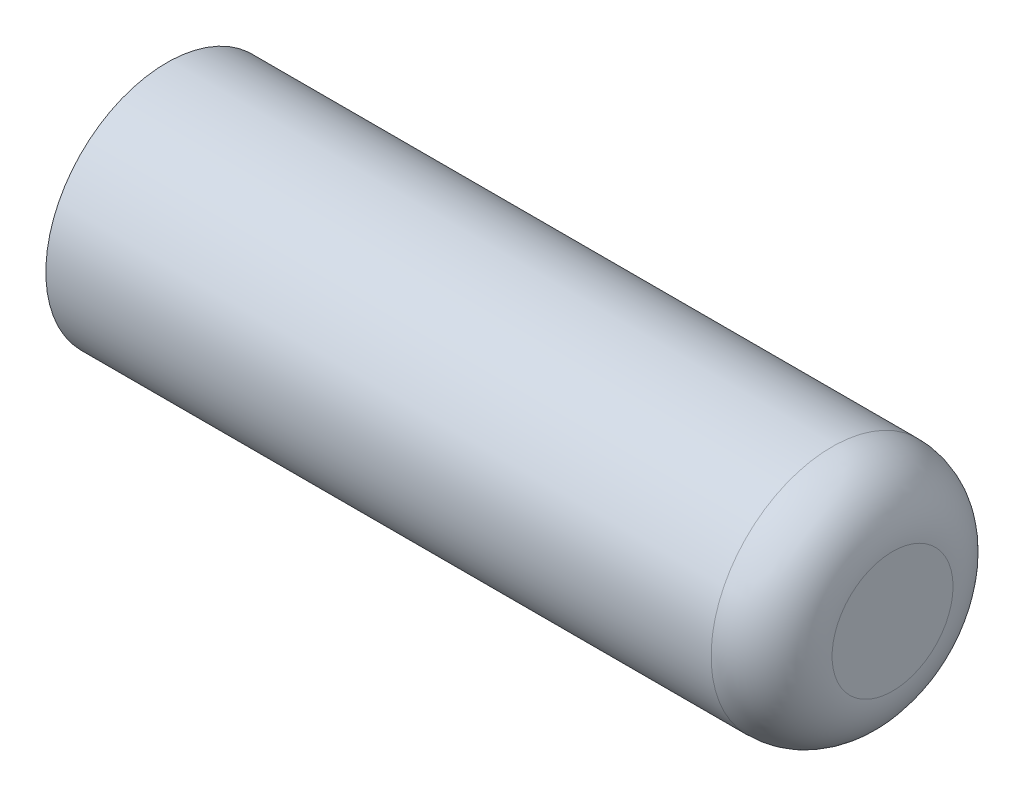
ISO-10303-21;
HEADER;
FILE_DESCRIPTION(('STEP AP214'),'2;1');
FILE_NAME('part.step','',(''),(''),'','','');
FILE_SCHEMA(('AUTOMOTIVE_DESIGN { 1 0 10303 214 1 1 1 1 }'));
ENDSEC;
DATA;
#1=APPLICATION_CONTEXT('core data for automotive mechanical design processes');
#2=APPLICATION_PROTOCOL_DEFINITION('international standard','automotive_design',2000,#1);
#3=PRODUCT_CONTEXT('',#1,'mechanical');
#4=PRODUCT('Part','Part','',(#3));
#5=PRODUCT_RELATED_PRODUCT_CATEGORY('part','',(#4));
#6=PRODUCT_DEFINITION_FORMATION('','',#4);
#7=PRODUCT_DEFINITION_CONTEXT('part definition',#1,'design');
#8=PRODUCT_DEFINITION('design','',#6,#7);
#9=PRODUCT_DEFINITION_SHAPE('','',#8);
#10=(LENGTH_UNIT() NAMED_UNIT(*) SI_UNIT(.MILLI.,.METRE.));
#11=(NAMED_UNIT(*) PLANE_ANGLE_UNIT() SI_UNIT($,.RADIAN.));
#12=(NAMED_UNIT(*) SI_UNIT($,.STERADIAN.) SOLID_ANGLE_UNIT());
#13=UNCERTAINTY_MEASURE_WITH_UNIT(LENGTH_MEASURE(1.E-05),#10,'distance_accuracy_value','');
#14=(GEOMETRIC_REPRESENTATION_CONTEXT(3) GLOBAL_UNCERTAINTY_ASSIGNED_CONTEXT((#13)) GLOBAL_UNIT_ASSIGNED_CONTEXT((#10,
#11,#12)) REPRESENTATION_CONTEXT('',''));
#15=CARTESIAN_POINT('',(0.,0.,0.));
#16=DIRECTION('',(0.,0.,1.));
#17=DIRECTION('',(1.,0.,0.));
#18=AXIS2_PLACEMENT_3D('',#15,#16,#17);
#19=CARTESIAN_POINT('',(30.,0.,0.));
#20=DIRECTION('',(-1.,0.,0.));
#21=DIRECTION('',(0.,0.,1.));
#22=AXIS2_PLACEMENT_3D('',#19,#20,#21);
#23=CYLINDRICAL_SURFACE('',#22,5.);
#24=CARTESIAN_POINT('',(27.5,0.,0.));
#25=DIRECTION('',(1.,0.,0.));
#26=DIRECTION('',(0.,0.,-1.));
#27=AXIS2_PLACEMENT_3D('',#24,#25,#26);
#28=CIRCLE('',#27,5.);
#29=CARTESIAN_POINT('',(27.5,0.,-5.));
#30=VERTEX_POINT('',#29);
#31=EDGE_CURVE('E10',#30,#30,#28,.F.);
#32=ORIENTED_EDGE('',*,*,#31,.T.);
#33=EDGE_LOOP('',(#32));
#34=FACE_BOUND('',#33,.T.);
#35=CARTESIAN_POINT('',(0.,0.,0.));
#36=DIRECTION('',(1.,0.,0.));
#37=DIRECTION('',(0.,0.,-1.));
#38=AXIS2_PLACEMENT_3D('',#35,#36,#37);
#39=CIRCLE('',#38,5.);
#40=CARTESIAN_POINT('',(0.,0.,-5.));
#41=VERTEX_POINT('',#40);
#42=EDGE_CURVE('E41',#41,#41,#39,.T.);
#43=ORIENTED_EDGE('',*,*,#42,.T.);
#44=EDGE_LOOP('',(#43));
#45=FACE_BOUND('',#44,.T.);
#46=ADVANCED_FACE('F30',(#34,#45),#23,.T.);
#47=CARTESIAN_POINT('',(30.,0.,0.));
#48=DIRECTION('',(1.,0.,0.));
#49=DIRECTION('',(0.,0.,-1.));
#50=AXIS2_PLACEMENT_3D('',#47,#48,#49);
#51=PLANE('',#50);
#52=CARTESIAN_POINT('',(30.,0.,0.));
#53=DIRECTION('',(1.,0.,0.));
#54=DIRECTION('',(0.,0.,-1.));
#55=AXIS2_PLACEMENT_3D('',#52,#53,#54);
#56=CIRCLE('',#55,2.5);
#57=CARTESIAN_POINT('',(30.,0.,-2.5));
#58=VERTEX_POINT('',#57);
#59=EDGE_CURVE('E37',#58,#58,#56,.T.);
#60=ORIENTED_EDGE('',*,*,#59,.T.);
#61=EDGE_LOOP('',(#60));
#62=FACE_BOUND('',#61,.T.);
#63=ADVANCED_FACE('F65',(#62),#51,.T.);
#64=CARTESIAN_POINT('',(0.,0.,0.));
#65=DIRECTION('',(1.,0.,0.));
#66=DIRECTION('',(0.,0.,-1.));
#67=AXIS2_PLACEMENT_3D('',#64,#65,#66);
#68=PLANE('',#67);
#69=CARTESIAN_POINT('',(0.,0.,0.));
#70=DIRECTION('',(-1.,0.,0.));
#71=DIRECTION('',(0.,0.,1.));
#72=AXIS2_PLACEMENT_3D('',#69,#70,#71);
#73=CIRCLE('',#72,1.5);
#74=CARTESIAN_POINT('',(0.,0.,1.5));
#75=VERTEX_POINT('',#74);
#76=EDGE_CURVE('E48',#75,#75,#73,.T.);
#77=ORIENTED_EDGE('',*,*,#76,.F.);
#78=EDGE_LOOP('',(#77));
#79=FACE_BOUND('',#78,.T.);
#80=ORIENTED_EDGE('',*,*,#42,.F.);
#81=EDGE_LOOP('',(#80));
#82=FACE_BOUND('',#81,.T.);
#83=ADVANCED_FACE('F62',(#79,#82),#68,.F.);
#84=CARTESIAN_POINT('',(27.5,0.,0.));
#85=DIRECTION('',(1.,0.,0.));
#86=DIRECTION('',(0.,0.,-1.));
#87=AXIS2_PLACEMENT_3D('',#84,#85,#86);
#88=TOROIDAL_SURFACE('',#87,2.5,2.5);
#89=ORIENTED_EDGE('',*,*,#31,.F.);
#90=EDGE_LOOP('',(#89));
#91=FACE_BOUND('',#90,.T.);
#92=ORIENTED_EDGE('',*,*,#59,.F.);
#93=EDGE_LOOP('',(#92));
#94=FACE_BOUND('',#93,.T.);
#95=ADVANCED_FACE('F32',(#91,#94),#88,.T.);
#96=CARTESIAN_POINT('',(10.,0.,0.));
#97=DIRECTION('',(-1.,0.,0.));
#98=DIRECTION('',(0.,0.,1.));
#99=AXIS2_PLACEMENT_3D('',#96,#97,#98);
#100=CYLINDRICAL_SURFACE('',#99,1.5);
#101=CARTESIAN_POINT('',(10.,0.,0.));
#102=DIRECTION('',(-1.,0.,0.));
#103=DIRECTION('',(0.,0.,1.));
#104=AXIS2_PLACEMENT_3D('',#101,#102,#103);
#105=CIRCLE('',#104,1.5);
#106=CARTESIAN_POINT('',(10.,0.,1.5));
#107=VERTEX_POINT('',#106);
#108=EDGE_CURVE('E45',#107,#107,#105,.T.);
#109=ORIENTED_EDGE('',*,*,#108,.F.);
#110=EDGE_LOOP('',(#109));
#111=FACE_BOUND('',#110,.T.);
#112=ORIENTED_EDGE('',*,*,#76,.T.);
#113=EDGE_LOOP('',(#112));
#114=FACE_BOUND('',#113,.T.);
#115=ADVANCED_FACE('F56',(#111,#114),#100,.F.);
#116=CARTESIAN_POINT('',(10.,0.,0.));
#117=DIRECTION('',(-1.,0.,0.));
#118=DIRECTION('',(0.,0.,1.));
#119=AXIS2_PLACEMENT_3D('',#116,#117,#118);
#120=PLANE('',#119);
#121=ORIENTED_EDGE('',*,*,#108,.T.);
#122=EDGE_LOOP('',(#121));
#123=FACE_BOUND('',#122,.T.);
#124=ADVANCED_FACE('F54',(#123),#120,.T.);
#125=CLOSED_SHELL('',(#46,#63,#83,#95,#115,#124));
#126=MANIFOLD_SOLID_BREP('B2',#125);
#127=ADVANCED_BREP_SHAPE_REPRESENTATION('',(#18,#126),#14);
#128=SHAPE_DEFINITION_REPRESENTATION(#9,#127);
ENDSEC;
END-ISO-10303-21;
